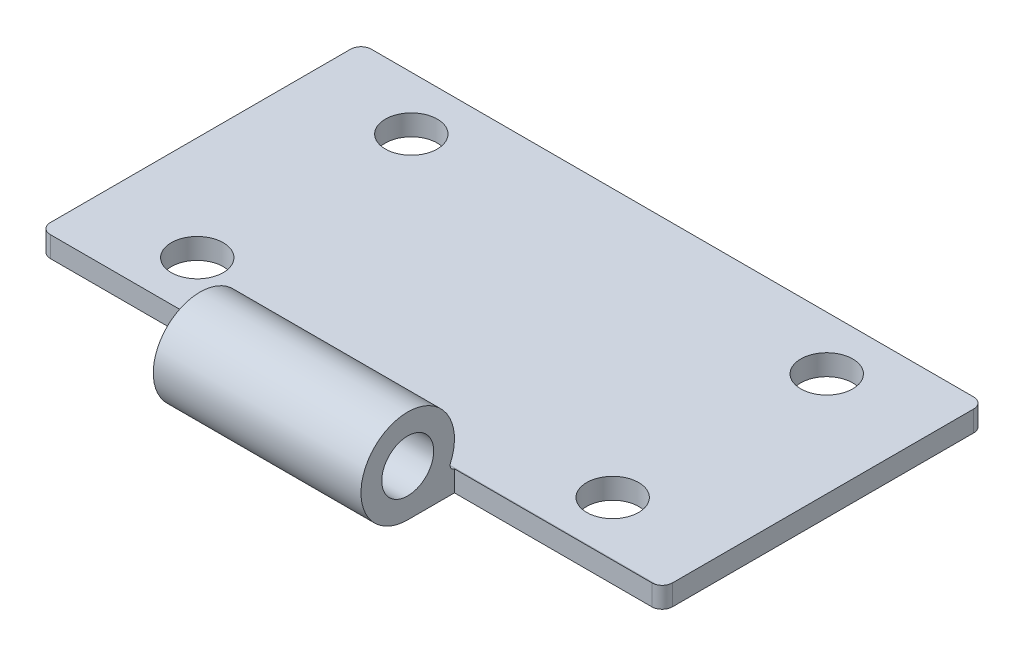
ISO-10303-21;
HEADER;
FILE_DESCRIPTION(('STEP AP214'),'2;1');
FILE_NAME('part.step','',(''),(''),'','','');
FILE_SCHEMA(('AUTOMOTIVE_DESIGN { 1 0 10303 214 1 1 1 1 }'));
ENDSEC;
DATA;
#1=APPLICATION_CONTEXT('core data for automotive mechanical design processes');
#2=APPLICATION_PROTOCOL_DEFINITION('international standard','automotive_design',2000,#1);
#3=PRODUCT_CONTEXT('',#1,'mechanical');
#4=PRODUCT('Part','Part','',(#3));
#5=PRODUCT_RELATED_PRODUCT_CATEGORY('part','',(#4));
#6=PRODUCT_DEFINITION_FORMATION('','',#4);
#7=PRODUCT_DEFINITION_CONTEXT('part definition',#1,'design');
#8=PRODUCT_DEFINITION('design','',#6,#7);
#9=PRODUCT_DEFINITION_SHAPE('','',#8);
#10=(LENGTH_UNIT() NAMED_UNIT(*) SI_UNIT(.MILLI.,.METRE.));
#11=(NAMED_UNIT(*) PLANE_ANGLE_UNIT() SI_UNIT($,.RADIAN.));
#12=(NAMED_UNIT(*) SI_UNIT($,.STERADIAN.) SOLID_ANGLE_UNIT());
#13=UNCERTAINTY_MEASURE_WITH_UNIT(LENGTH_MEASURE(1.E-05),#10,'distance_accuracy_value','');
#14=(GEOMETRIC_REPRESENTATION_CONTEXT(3) GLOBAL_UNCERTAINTY_ASSIGNED_CONTEXT((#13)) GLOBAL_UNIT_ASSIGNED_CONTEXT((#10,
#11,#12)) REPRESENTATION_CONTEXT('',''));
#15=CARTESIAN_POINT('',(0.,0.,0.));
#16=DIRECTION('',(0.,0.,1.));
#17=DIRECTION('',(1.,0.,0.));
#18=AXIS2_PLACEMENT_3D('',#15,#16,#17);
#19=CARTESIAN_POINT('',(60.,2.5,-217.887613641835));
#20=DIRECTION('',(1.,0.,0.));
#21=DIRECTION('',(0.,0.,-1.));
#22=AXIS2_PLACEMENT_3D('',#19,#20,#21);
#23=PLANE('',#22);
#24=DIRECTION('',(0.,0.,-1.));
#25=VECTOR('',#24,1.);
#26=CARTESIAN_POINT('',(60.,0.,-248.805037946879));
#27=LINE('',#26,#25);
#28=CARTESIAN_POINT('',(60.,0.,-218.805037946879));
#29=VERTEX_POINT('',#28);
#30=CARTESIAN_POINT('',(60.,0.,-247.805037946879));
#31=VERTEX_POINT('',#30);
#32=EDGE_CURVE('E185',#29,#31,#27,.T.);
#33=ORIENTED_EDGE('',*,*,#32,.T.);
#34=DIRECTION('',(0.,1.,0.));
#35=VECTOR('',#34,1.);
#36=CARTESIAN_POINT('',(60.,2.,-247.805037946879));
#37=LINE('',#36,#35);
#38=CARTESIAN_POINT('',(60.,2.,-247.805037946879));
#39=VERTEX_POINT('',#38);
#40=EDGE_CURVE('E235',#31,#39,#37,.T.);
#41=ORIENTED_EDGE('',*,*,#40,.T.);
#42=DIRECTION('',(0.,0.,1.));
#43=VECTOR('',#42,1.);
#44=CARTESIAN_POINT('',(60.,2.,-248.805037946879));
#45=LINE('',#44,#43);
#46=CARTESIAN_POINT('',(60.,2.,-218.805037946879));
#47=VERTEX_POINT('',#46);
#48=EDGE_CURVE('E182',#39,#47,#45,.T.);
#49=ORIENTED_EDGE('',*,*,#48,.T.);
#50=DIRECTION('',(0.,-1.,0.));
#51=VECTOR('',#50,1.);
#52=CARTESIAN_POINT('',(60.,2.5,-218.805037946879));
#53=LINE('',#52,#51);
#54=EDGE_CURVE('E232',#47,#29,#53,.T.);
#55=ORIENTED_EDGE('',*,*,#54,.T.);
#56=EDGE_LOOP('',(#33,#41,#49,#55));
#57=FACE_BOUND('',#56,.T.);
#58=ADVANCED_FACE('F40',(#57),#23,.T.);
#59=CARTESIAN_POINT('',(0.,2.5,-217.887613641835));
#60=DIRECTION('',(1.,0.,0.));
#61=DIRECTION('',(0.,0.,-1.));
#62=AXIS2_PLACEMENT_3D('',#59,#60,#61);
#63=PLANE('',#62);
#64=DIRECTION('',(0.,0.,1.));
#65=VECTOR('',#64,1.);
#66=CARTESIAN_POINT('',(0.,2.,-248.805037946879));
#67=LINE('',#66,#65);
#68=CARTESIAN_POINT('',(0.,2.,-247.805037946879));
#69=VERTEX_POINT('',#68);
#70=CARTESIAN_POINT('',(0.,2.,-218.887613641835));
#71=VERTEX_POINT('',#70);
#72=EDGE_CURVE('E181',#69,#71,#67,.T.);
#73=ORIENTED_EDGE('',*,*,#72,.F.);
#74=DIRECTION('',(0.,1.,0.));
#75=VECTOR('',#74,1.);
#76=CARTESIAN_POINT('',(0.,2.5,-247.805037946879));
#77=LINE('',#76,#75);
#78=CARTESIAN_POINT('',(0.,0.,-247.805037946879));
#79=VERTEX_POINT('',#78);
#80=EDGE_CURVE('E223',#69,#79,#77,.F.);
#81=ORIENTED_EDGE('',*,*,#80,.T.);
#82=DIRECTION('',(0.,0.,-1.));
#83=VECTOR('',#82,1.);
#84=CARTESIAN_POINT('',(0.,0.,-248.805037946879));
#85=LINE('',#84,#83);
#86=CARTESIAN_POINT('',(0.,0.,-218.887613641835));
#87=VERTEX_POINT('',#86);
#88=EDGE_CURVE('E186',#87,#79,#85,.T.);
#89=ORIENTED_EDGE('',*,*,#88,.F.);
#90=DIRECTION('',(0.,-1.,0.));
#91=VECTOR('',#90,1.);
#92=CARTESIAN_POINT('',(0.,2.,-218.887613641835));
#93=LINE('',#92,#91);
#94=EDGE_CURVE('E221',#87,#71,#93,.F.);
#95=ORIENTED_EDGE('',*,*,#94,.T.);
#96=EDGE_LOOP('',(#73,#81,#89,#95));
#97=FACE_BOUND('',#96,.T.);
#98=ADVANCED_FACE('F252',(#97),#63,.F.);
#99=CARTESIAN_POINT('',(60.,2.5,-217.887613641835));
#100=DIRECTION('',(-1.,0.,0.));
#101=DIRECTION('',(0.,0.,1.));
#102=AXIS2_PLACEMENT_3D('',#99,#100,#101);
#103=CYLINDRICAL_SURFACE('',#102,0.499999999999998);
#104=DIRECTION('',(-1.,0.,0.));
#105=VECTOR('',#104,1.);
#106=CARTESIAN_POINT('',(60.,2.00686588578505,-217.805037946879));
#107=LINE('',#106,#105);
#108=CARTESIAN_POINT('',(59.,2.00686588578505,-217.805037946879));
#109=VERTEX_POINT('',#108);
#110=CARTESIAN_POINT('',(40.,2.00686588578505,-217.805037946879));
#111=VERTEX_POINT('',#110);
#112=EDGE_CURVE('E177',#109,#111,#107,.T.);
#113=ORIENTED_EDGE('',*,*,#112,.F.);
#114=CARTESIAN_POINT('',(59.,2.00686588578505,-217.805037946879));
#115=CARTESIAN_POINT('',(59.0281968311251,2.00688494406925,-217.80503464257));
#116=CARTESIAN_POINT('',(59.056392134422,2.00666672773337,-217.806230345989));
#117=CARTESIAN_POINT('',(59.1125907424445,2.0058941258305,-217.810997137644));
#118=CARTESIAN_POINT('',(59.140593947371,2.00533957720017,-217.814569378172));
#119=CARTESIAN_POINT('',(59.1957223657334,2.00404397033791,-217.823986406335));
#120=CARTESIAN_POINT('',(59.2228544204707,2.00330621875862,-217.829791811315));
#121=CARTESIAN_POINT('',(59.2765295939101,2.00188910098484,-217.843633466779));
#122=CARTESIAN_POINT('',(59.3030731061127,2.00120969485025,-217.851668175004));
#123=CARTESIAN_POINT('',(59.3408174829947,2.00050324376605,-217.864828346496));
#124=CARTESIAN_POINT('',(59.3523260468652,2.0003236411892,-217.869080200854));
#125=CARTESIAN_POINT('',(59.3752232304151,2.00007195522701,-217.878021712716));
#126=CARTESIAN_POINT('',(59.3866112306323,2.00000028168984,-217.882712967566));
#127=CARTESIAN_POINT('',(59.3979103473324,2.,-217.887613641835));
#128=B_SPLINE_CURVE_WITH_KNOTS('',3,(#114,#115,#116,#117,#118,#119,#120,#121,#122,#123,#124,
#125,#126,#127),.UNSPECIFIED.,.F.,.F.,(4,2,2,2,2,2,4),(0.,0.0845622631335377,0.169165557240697,
0.252340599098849,0.33545824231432,0.372261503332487,0.40920417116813),.UNSPECIFIED.);
#129=CARTESIAN_POINT('',(59.3979103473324,2.,-217.887613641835));
#130=VERTEX_POINT('',#129);
#131=EDGE_CURVE('E48',#109,#130,#128,.T.);
#132=ORIENTED_EDGE('',*,*,#131,.T.);
#133=DIRECTION('',(-1.,0.,0.));
#134=VECTOR('',#133,1.);
#135=CARTESIAN_POINT('',(60.,2.,-217.887613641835));
#136=LINE('',#135,#134);
#137=CARTESIAN_POINT('',(20.,2.,-217.887613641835));
#138=VERTEX_POINT('',#137);
#139=EDGE_CURVE('E199',#130,#138,#136,.T.);
#140=ORIENTED_EDGE('',*,*,#139,.T.);
#141=CARTESIAN_POINT('',(20.,2.5,-217.887613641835));
#142=DIRECTION('',(-1.,0.,0.));
#143=DIRECTION('',(0.,0.,1.));
#144=AXIS2_PLACEMENT_3D('',#141,#142,#143);
#145=CIRCLE('',#144,0.499999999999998);
#146=CARTESIAN_POINT('',(20.,2.69999999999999,-217.429356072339));
#147=VERTEX_POINT('',#146);
#148=EDGE_CURVE('E140',#147,#138,#145,.F.);
#149=ORIENTED_EDGE('',*,*,#148,.F.);
#150=DIRECTION('',(-1.,0.,0.));
#151=VECTOR('',#150,1.);
#152=CARTESIAN_POINT('',(60.,2.69999999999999,-217.429356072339));
#153=LINE('',#152,#151);
#154=CARTESIAN_POINT('',(40.,2.69999999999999,-217.429356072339));
#155=VERTEX_POINT('',#154);
#156=EDGE_CURVE('E196',#155,#147,#153,.T.);
#157=ORIENTED_EDGE('',*,*,#156,.F.);
#158=CARTESIAN_POINT('',(40.,2.5,-217.887613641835));
#159=DIRECTION('',(1.,0.,0.));
#160=DIRECTION('',(0.,0.,-1.));
#161=AXIS2_PLACEMENT_3D('',#158,#159,#160);
#162=CIRCLE('',#161,0.499999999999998);
#163=EDGE_CURVE('E171',#111,#155,#162,.F.);
#164=ORIENTED_EDGE('',*,*,#163,.F.);
#165=EDGE_LOOP('',(#113,#132,#140,#149,#157,#164));
#166=FACE_BOUND('',#165,.T.);
#167=ADVANCED_FACE('F246',(#166),#103,.F.);
#168=CARTESIAN_POINT('',(60.,4.5,-213.305037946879));
#169=DIRECTION('',(-1.,0.,0.));
#170=DIRECTION('',(0.,0.,1.));
#171=AXIS2_PLACEMENT_3D('',#168,#169,#170);
#172=CYLINDRICAL_SURFACE('',#171,4.49999999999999);
#173=CARTESIAN_POINT('',(20.,4.5,-213.305037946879));
#174=DIRECTION('',(-1.,0.,0.));
#175=DIRECTION('',(0.,0.,1.));
#176=AXIS2_PLACEMENT_3D('',#173,#174,#175);
#177=CIRCLE('',#176,4.49999999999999);
#178=CARTESIAN_POINT('',(20.,0.,-213.305037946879));
#179=VERTEX_POINT('',#178);
#180=EDGE_CURVE('E174',#179,#147,#177,.T.);
#181=ORIENTED_EDGE('',*,*,#180,.F.);
#182=DIRECTION('',(-1.,0.,0.));
#183=VECTOR('',#182,1.);
#184=CARTESIAN_POINT('',(60.,0.,-213.305037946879));
#185=LINE('',#184,#183);
#186=CARTESIAN_POINT('',(40.,0.,-213.305037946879));
#187=VERTEX_POINT('',#186);
#188=EDGE_CURVE('E155',#187,#179,#185,.T.);
#189=ORIENTED_EDGE('',*,*,#188,.F.);
#190=CARTESIAN_POINT('',(40.,4.5,-213.305037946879));
#191=DIRECTION('',(1.,0.,0.));
#192=DIRECTION('',(0.,0.,-1.));
#193=AXIS2_PLACEMENT_3D('',#190,#191,#192);
#194=CIRCLE('',#193,4.49999999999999);
#195=EDGE_CURVE('E168',#155,#187,#194,.T.);
#196=ORIENTED_EDGE('',*,*,#195,.F.);
#197=ORIENTED_EDGE('',*,*,#156,.T.);
#198=EDGE_LOOP('',(#181,#189,#196,#197));
#199=FACE_BOUND('',#198,.T.);
#200=ADVANCED_FACE('F251',(#199),#172,.T.);
#201=CARTESIAN_POINT('',(60.,0.,-248.805037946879));
#202=DIRECTION('',(0.,1.,0.));
#203=DIRECTION('',(0.,0.,1.));
#204=AXIS2_PLACEMENT_3D('',#201,#202,#203);
#205=PLANE('',#204);
#206=CARTESIAN_POINT('',(50.,0.,-243.652133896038));
#207=DIRECTION('',(0.,1.,0.));
#208=DIRECTION('',(0.,0.,1.));
#209=AXIS2_PLACEMENT_3D('',#206,#207,#208);
#210=CIRCLE('',#209,2.5);
#211=CARTESIAN_POINT('',(50.,0.,-241.152133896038));
#212=VERTEX_POINT('',#211);
#213=EDGE_CURVE('E162',#212,#212,#210,.T.);
#214=ORIENTED_EDGE('',*,*,#213,.T.);
#215=EDGE_LOOP('',(#214));
#216=FACE_BOUND('',#215,.T.);
#217=CARTESIAN_POINT('',(50.,0.,-223.040517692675));
#218=DIRECTION('',(0.,1.,0.));
#219=DIRECTION('',(0.,0.,1.));
#220=AXIS2_PLACEMENT_3D('',#217,#218,#219);
#221=CIRCLE('',#220,2.5);
#222=CARTESIAN_POINT('',(50.,0.,-220.540517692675));
#223=VERTEX_POINT('',#222);
#224=EDGE_CURVE('E299',#223,#223,#221,.T.);
#225=ORIENTED_EDGE('',*,*,#224,.T.);
#226=EDGE_LOOP('',(#225));
#227=FACE_BOUND('',#226,.T.);
#228=CARTESIAN_POINT('',(10.,0.,-223.040517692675));
#229=DIRECTION('',(0.,1.,0.));
#230=DIRECTION('',(0.,0.,1.));
#231=AXIS2_PLACEMENT_3D('',#228,#229,#230);
#232=CIRCLE('',#231,2.5);
#233=CARTESIAN_POINT('',(10.,0.,-220.540517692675));
#234=VERTEX_POINT('',#233);
#235=EDGE_CURVE('E303',#234,#234,#232,.T.);
#236=ORIENTED_EDGE('',*,*,#235,.T.);
#237=EDGE_LOOP('',(#236));
#238=FACE_BOUND('',#237,.T.);
#239=CARTESIAN_POINT('',(10.,0.,-243.652133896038));
#240=DIRECTION('',(0.,1.,0.));
#241=DIRECTION('',(0.,0.,1.));
#242=AXIS2_PLACEMENT_3D('',#239,#240,#241);
#243=CIRCLE('',#242,2.5);
#244=CARTESIAN_POINT('',(10.,0.,-241.152133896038));
#245=VERTEX_POINT('',#244);
#246=EDGE_CURVE('E306',#245,#245,#243,.T.);
#247=ORIENTED_EDGE('',*,*,#246,.T.);
#248=EDGE_LOOP('',(#247));
#249=FACE_BOUND('',#248,.T.);
#250=ORIENTED_EDGE('',*,*,#88,.T.);
#251=CARTESIAN_POINT('',(1.,0.,-247.805037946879));
#252=DIRECTION('',(0.,1.,0.));
#253=DIRECTION('',(0.,0.,1.));
#254=AXIS2_PLACEMENT_3D('',#251,#252,#253);
#255=CIRCLE('',#254,1.);
#256=CARTESIAN_POINT('',(1.,0.,-248.805037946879));
#257=VERTEX_POINT('',#256);
#258=EDGE_CURVE('E230',#79,#257,#255,.F.);
#259=ORIENTED_EDGE('',*,*,#258,.T.);
#260=DIRECTION('',(-1.,0.,0.));
#261=VECTOR('',#260,1.);
#262=CARTESIAN_POINT('',(60.,0.,-248.805037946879));
#263=LINE('',#262,#261);
#264=CARTESIAN_POINT('',(59.,0.,-248.805037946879));
#265=VERTEX_POINT('',#264);
#266=EDGE_CURVE('E189',#265,#257,#263,.T.);
#267=ORIENTED_EDGE('',*,*,#266,.F.);
#268=CARTESIAN_POINT('',(59.,0.,-247.805037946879));
#269=DIRECTION('',(0.,1.,0.));
#270=DIRECTION('',(0.,0.,1.));
#271=AXIS2_PLACEMENT_3D('',#268,#269,#270);
#272=CIRCLE('',#271,1.);
#273=EDGE_CURVE('E228',#265,#31,#272,.F.);
#274=ORIENTED_EDGE('',*,*,#273,.T.);
#275=ORIENTED_EDGE('',*,*,#32,.F.);
#276=CARTESIAN_POINT('',(59.,0.,-218.805037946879));
#277=DIRECTION('',(0.,1.,0.));
#278=DIRECTION('',(0.,0.,1.));
#279=AXIS2_PLACEMENT_3D('',#276,#277,#278);
#280=CIRCLE('',#279,1.);
#281=CARTESIAN_POINT('',(59.,0.,-217.805037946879));
#282=VERTEX_POINT('',#281);
#283=EDGE_CURVE('E63',#29,#282,#280,.F.);
#284=ORIENTED_EDGE('',*,*,#283,.T.);
#285=DIRECTION('',(-1.,0.,0.));
#286=VECTOR('',#285,1.);
#287=CARTESIAN_POINT('',(60.,0.,-217.805037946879));
#288=LINE('',#287,#286);
#289=CARTESIAN_POINT('',(40.,0.,-217.805037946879));
#290=VERTEX_POINT('',#289);
#291=EDGE_CURVE('E165',#282,#290,#288,.T.);
#292=ORIENTED_EDGE('',*,*,#291,.T.);
#293=DIRECTION('',(0.,0.,1.));
#294=VECTOR('',#293,1.);
#295=CARTESIAN_POINT('',(40.,0.,-217.805037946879));
#296=LINE('',#295,#294);
#297=EDGE_CURVE('E159',#290,#187,#296,.T.);
#298=ORIENTED_EDGE('',*,*,#297,.T.);
#299=ORIENTED_EDGE('',*,*,#188,.T.);
#300=DIRECTION('',(0.,0.,-1.));
#301=VECTOR('',#300,1.);
#302=CARTESIAN_POINT('',(20.,0.,-208.805037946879));
#303=LINE('',#302,#301);
#304=CARTESIAN_POINT('',(20.,0.,-217.887613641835));
#305=VERTEX_POINT('',#304);
#306=EDGE_CURVE('E137',#179,#305,#303,.T.);
#307=ORIENTED_EDGE('',*,*,#306,.T.);
#308=DIRECTION('',(-1.,0.,0.));
#309=VECTOR('',#308,1.);
#310=CARTESIAN_POINT('',(0.,0.,-217.887613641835));
#311=LINE('',#310,#309);
#312=CARTESIAN_POINT('',(1.,0.,-217.887613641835));
#313=VERTEX_POINT('',#312);
#314=EDGE_CURVE('E145',#305,#313,#311,.T.);
#315=ORIENTED_EDGE('',*,*,#314,.T.);
#316=CARTESIAN_POINT('',(1.,0.,-218.887613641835));
#317=DIRECTION('',(0.,1.,0.));
#318=DIRECTION('',(0.,0.,1.));
#319=AXIS2_PLACEMENT_3D('',#316,#317,#318);
#320=CIRCLE('',#319,1.);
#321=EDGE_CURVE('E225',#313,#87,#320,.F.);
#322=ORIENTED_EDGE('',*,*,#321,.T.);
#323=EDGE_LOOP('',(#250,#259,#267,#274,#275,#284,#292,#298,#299,#307,#315,#322));
#324=FACE_BOUND('',#323,.T.);
#325=ADVANCED_FACE('F152',(#216,#227,#238,#249,#324),#205,.F.);
#326=CARTESIAN_POINT('',(60.,0.,-248.805037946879));
#327=DIRECTION('',(0.,0.,1.));
#328=DIRECTION('',(1.,0.,0.));
#329=AXIS2_PLACEMENT_3D('',#326,#327,#328);
#330=PLANE('',#329);
#331=ORIENTED_EDGE('',*,*,#266,.T.);
#332=DIRECTION('',(0.,1.,0.));
#333=VECTOR('',#332,1.);
#334=CARTESIAN_POINT('',(1.,0.,-248.805037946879));
#335=LINE('',#334,#333);
#336=CARTESIAN_POINT('',(1.,2.,-248.805037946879));
#337=VERTEX_POINT('',#336);
#338=EDGE_CURVE('E210',#257,#337,#335,.T.);
#339=ORIENTED_EDGE('',*,*,#338,.T.);
#340=DIRECTION('',(-1.,0.,0.));
#341=VECTOR('',#340,1.);
#342=CARTESIAN_POINT('',(60.,2.,-248.805037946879));
#343=LINE('',#342,#341);
#344=CARTESIAN_POINT('',(59.,2.,-248.805037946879));
#345=VERTEX_POINT('',#344);
#346=EDGE_CURVE('E201',#345,#337,#343,.T.);
#347=ORIENTED_EDGE('',*,*,#346,.F.);
#348=DIRECTION('',(0.,1.,0.));
#349=VECTOR('',#348,1.);
#350=CARTESIAN_POINT('',(59.,0.,-248.805037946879));
#351=LINE('',#350,#349);
#352=EDGE_CURVE('E204',#345,#265,#351,.F.);
#353=ORIENTED_EDGE('',*,*,#352,.T.);
#354=EDGE_LOOP('',(#331,#339,#347,#353));
#355=FACE_BOUND('',#354,.T.);
#356=ADVANCED_FACE('F259',(#355),#330,.F.);
#357=CARTESIAN_POINT('',(60.,2.,-248.805037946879));
#358=DIRECTION('',(0.,-1.,0.));
#359=DIRECTION('',(0.,0.,-1.));
#360=AXIS2_PLACEMENT_3D('',#357,#358,#359);
#361=PLANE('',#360);
#362=CARTESIAN_POINT('',(50.,2.,-243.652133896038));
#363=DIRECTION('',(0.,1.,0.));
#364=DIRECTION('',(0.,0.,1.));
#365=AXIS2_PLACEMENT_3D('',#362,#363,#364);
#366=CIRCLE('',#365,2.5);
#367=CARTESIAN_POINT('',(50.,2.,-241.152133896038));
#368=VERTEX_POINT('',#367);
#369=EDGE_CURVE('E315',#368,#368,#366,.T.);
#370=ORIENTED_EDGE('',*,*,#369,.F.);
#371=EDGE_LOOP('',(#370));
#372=FACE_BOUND('',#371,.T.);
#373=CARTESIAN_POINT('',(50.,2.,-223.040517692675));
#374=DIRECTION('',(0.,1.,0.));
#375=DIRECTION('',(0.,0.,1.));
#376=AXIS2_PLACEMENT_3D('',#373,#374,#375);
#377=CIRCLE('',#376,2.5);
#378=CARTESIAN_POINT('',(50.,2.,-220.540517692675));
#379=VERTEX_POINT('',#378);
#380=EDGE_CURVE('E318',#379,#379,#377,.T.);
#381=ORIENTED_EDGE('',*,*,#380,.F.);
#382=EDGE_LOOP('',(#381));
#383=FACE_BOUND('',#382,.T.);
#384=CARTESIAN_POINT('',(10.,2.,-223.040517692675));
#385=DIRECTION('',(0.,1.,0.));
#386=DIRECTION('',(0.,0.,1.));
#387=AXIS2_PLACEMENT_3D('',#384,#385,#386);
#388=CIRCLE('',#387,2.5);
#389=CARTESIAN_POINT('',(10.,2.,-220.540517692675));
#390=VERTEX_POINT('',#389);
#391=EDGE_CURVE('E312',#390,#390,#388,.T.);
#392=ORIENTED_EDGE('',*,*,#391,.F.);
#393=EDGE_LOOP('',(#392));
#394=FACE_BOUND('',#393,.T.);
#395=CARTESIAN_POINT('',(10.,2.,-243.652133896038));
#396=DIRECTION('',(0.,1.,0.));
#397=DIRECTION('',(0.,0.,1.));
#398=AXIS2_PLACEMENT_3D('',#395,#396,#397);
#399=CIRCLE('',#398,2.5);
#400=CARTESIAN_POINT('',(10.,2.,-241.152133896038));
#401=VERTEX_POINT('',#400);
#402=EDGE_CURVE('E308',#401,#401,#399,.T.);
#403=ORIENTED_EDGE('',*,*,#402,.F.);
#404=EDGE_LOOP('',(#403));
#405=FACE_BOUND('',#404,.T.);
#406=ORIENTED_EDGE('',*,*,#346,.T.);
#407=CARTESIAN_POINT('',(1.,2.,-247.805037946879));
#408=DIRECTION('',(0.,-1.,0.));
#409=DIRECTION('',(0.,0.,-1.));
#410=AXIS2_PLACEMENT_3D('',#407,#408,#409);
#411=CIRCLE('',#410,1.);
#412=EDGE_CURVE('E219',#337,#69,#411,.F.);
#413=ORIENTED_EDGE('',*,*,#412,.T.);
#414=ORIENTED_EDGE('',*,*,#72,.T.);
#415=CARTESIAN_POINT('',(1.,1.99999999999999,-218.887613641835));
#416=DIRECTION('',(0.,-1.,0.));
#417=DIRECTION('',(0.,0.,-1.));
#418=AXIS2_PLACEMENT_3D('',#415,#416,#417);
#419=CIRCLE('',#418,1.);
#420=CARTESIAN_POINT('',(1.,2.,-217.887613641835));
#421=VERTEX_POINT('',#420);
#422=EDGE_CURVE('E213',#71,#421,#419,.F.);
#423=ORIENTED_EDGE('',*,*,#422,.T.);
#424=DIRECTION('',(-1.,0.,0.));
#425=VECTOR('',#424,1.);
#426=CARTESIAN_POINT('',(60.,2.,-217.887613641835));
#427=LINE('',#426,#425);
#428=EDGE_CURVE('E179',#138,#421,#427,.T.);
#429=ORIENTED_EDGE('',*,*,#428,.F.);
#430=ORIENTED_EDGE('',*,*,#139,.F.);
#431=CARTESIAN_POINT('',(59.,2.,-218.805037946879));
#432=DIRECTION('',(0.,-1.,0.));
#433=DIRECTION('',(0.,0.,-1.));
#434=AXIS2_PLACEMENT_3D('',#431,#432,#433);
#435=CIRCLE('',#434,1.);
#436=EDGE_CURVE('E215',#130,#47,#435,.F.);
#437=ORIENTED_EDGE('',*,*,#436,.T.);
#438=ORIENTED_EDGE('',*,*,#48,.F.);
#439=CARTESIAN_POINT('',(59.,2.,-247.805037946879));
#440=DIRECTION('',(0.,-1.,0.));
#441=DIRECTION('',(0.,0.,-1.));
#442=AXIS2_PLACEMENT_3D('',#439,#440,#441);
#443=CIRCLE('',#442,1.);
#444=EDGE_CURVE('E217',#39,#345,#443,.F.);
#445=ORIENTED_EDGE('',*,*,#444,.T.);
#446=EDGE_LOOP('',(#406,#413,#414,#423,#429,#430,#437,#438,#445));
#447=FACE_BOUND('',#446,.T.);
#448=ADVANCED_FACE('F255',(#372,#383,#394,#405,#447),#361,.F.);
#449=CARTESIAN_POINT('',(60.,60.,-217.805037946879));
#450=DIRECTION('',(0.,0.,1.));
#451=DIRECTION('',(1.,0.,0.));
#452=AXIS2_PLACEMENT_3D('',#449,#450,#451);
#453=PLANE('',#452);
#454=ORIENTED_EDGE('',*,*,#291,.F.);
#455=DIRECTION('',(0.,-1.,0.));
#456=VECTOR('',#455,1.);
#457=CARTESIAN_POINT('',(59.,60.,-217.805037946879));
#458=LINE('',#457,#456);
#459=EDGE_CURVE('E55',#282,#109,#458,.F.);
#460=ORIENTED_EDGE('',*,*,#459,.T.);
#461=ORIENTED_EDGE('',*,*,#112,.T.);
#462=DIRECTION('',(0.,-1.,0.));
#463=VECTOR('',#462,1.);
#464=CARTESIAN_POINT('',(40.,60.,-217.805037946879));
#465=LINE('',#464,#463);
#466=EDGE_CURVE('E156',#111,#290,#465,.T.);
#467=ORIENTED_EDGE('',*,*,#466,.T.);
#468=EDGE_LOOP('',(#454,#460,#461,#467));
#469=FACE_BOUND('',#468,.T.);
#470=ADVANCED_FACE('F258',(#469),#453,.T.);
#471=CARTESIAN_POINT('',(40.,60.,-217.805037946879));
#472=DIRECTION('',(1.,0.,0.));
#473=DIRECTION('',(0.,0.,-1.));
#474=AXIS2_PLACEMENT_3D('',#471,#472,#473);
#475=PLANE('',#474);
#476=CARTESIAN_POINT('',(40.,4.5,-213.305037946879));
#477=DIRECTION('',(1.,0.,0.));
#478=DIRECTION('',(0.,0.,-1.));
#479=AXIS2_PLACEMENT_3D('',#476,#477,#478);
#480=CIRCLE('',#479,2.5);
#481=CARTESIAN_POINT('',(40.,4.5,-215.805037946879));
#482=VERTEX_POINT('',#481);
#483=EDGE_CURVE('E144',#482,#482,#480,.T.);
#484=ORIENTED_EDGE('',*,*,#483,.F.);
#485=EDGE_LOOP('',(#484));
#486=FACE_BOUND('',#485,.T.);
#487=ORIENTED_EDGE('',*,*,#195,.T.);
#488=ORIENTED_EDGE('',*,*,#297,.F.);
#489=ORIENTED_EDGE('',*,*,#466,.F.);
#490=ORIENTED_EDGE('',*,*,#163,.T.);
#491=EDGE_LOOP('',(#487,#488,#489,#490));
#492=FACE_BOUND('',#491,.T.);
#493=ADVANCED_FACE('F376',(#486,#492),#475,.T.);
#494=CARTESIAN_POINT('',(0.,60.,-217.887613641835));
#495=DIRECTION('',(0.,0.,1.));
#496=DIRECTION('',(1.,0.,0.));
#497=AXIS2_PLACEMENT_3D('',#494,#495,#496);
#498=PLANE('',#497);
#499=ORIENTED_EDGE('',*,*,#428,.T.);
#500=DIRECTION('',(0.,-1.,0.));
#501=VECTOR('',#500,1.);
#502=CARTESIAN_POINT('',(1.,0.,-217.887613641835));
#503=LINE('',#502,#501);
#504=EDGE_CURVE('E11',#421,#313,#503,.T.);
#505=ORIENTED_EDGE('',*,*,#504,.T.);
#506=ORIENTED_EDGE('',*,*,#314,.F.);
#507=DIRECTION('',(0.,-1.,0.));
#508=VECTOR('',#507,1.);
#509=CARTESIAN_POINT('',(20.,60.,-217.887613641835));
#510=LINE('',#509,#508);
#511=EDGE_CURVE('E133',#138,#305,#510,.T.);
#512=ORIENTED_EDGE('',*,*,#511,.F.);
#513=EDGE_LOOP('',(#499,#505,#506,#512));
#514=FACE_BOUND('',#513,.T.);
#515=ADVANCED_FACE('F148',(#514),#498,.T.);
#516=CARTESIAN_POINT('',(20.,60.,-208.805037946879));
#517=DIRECTION('',(-1.,0.,0.));
#518=DIRECTION('',(0.,0.,1.));
#519=AXIS2_PLACEMENT_3D('',#516,#517,#518);
#520=PLANE('',#519);
#521=CARTESIAN_POINT('',(20.,4.5,-213.305037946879));
#522=DIRECTION('',(-1.,0.,0.));
#523=DIRECTION('',(0.,0.,1.));
#524=AXIS2_PLACEMENT_3D('',#521,#522,#523);
#525=CIRCLE('',#524,2.5);
#526=CARTESIAN_POINT('',(20.,4.5,-210.805037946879));
#527=VERTEX_POINT('',#526);
#528=EDGE_CURVE('E170',#527,#527,#525,.T.);
#529=ORIENTED_EDGE('',*,*,#528,.F.);
#530=EDGE_LOOP('',(#529));
#531=FACE_BOUND('',#530,.T.);
#532=ORIENTED_EDGE('',*,*,#148,.T.);
#533=ORIENTED_EDGE('',*,*,#511,.T.);
#534=ORIENTED_EDGE('',*,*,#306,.F.);
#535=ORIENTED_EDGE('',*,*,#180,.T.);
#536=EDGE_LOOP('',(#532,#533,#534,#535));
#537=FACE_BOUND('',#536,.T.);
#538=ADVANCED_FACE('F135',(#531,#537),#520,.T.);
#539=CARTESIAN_POINT('',(60.,4.5,-213.305037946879));
#540=DIRECTION('',(-1.,0.,0.));
#541=DIRECTION('',(0.,0.,1.));
#542=AXIS2_PLACEMENT_3D('',#539,#540,#541);
#543=CYLINDRICAL_SURFACE('',#542,2.5);
#544=ORIENTED_EDGE('',*,*,#483,.T.);
#545=EDGE_LOOP('',(#544));
#546=FACE_BOUND('',#545,.T.);
#547=ORIENTED_EDGE('',*,*,#528,.T.);
#548=EDGE_LOOP('',(#547));
#549=FACE_BOUND('',#548,.T.);
#550=ADVANCED_FACE('F285',(#546,#549),#543,.F.);
#551=CARTESIAN_POINT('',(10.,-58.,-243.652133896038));
#552=DIRECTION('',(0.,1.,0.));
#553=DIRECTION('',(0.,0.,1.));
#554=AXIS2_PLACEMENT_3D('',#551,#552,#553);
#555=CYLINDRICAL_SURFACE('',#554,2.5);
#556=ORIENTED_EDGE('',*,*,#402,.T.);
#557=EDGE_LOOP('',(#556));
#558=FACE_BOUND('',#557,.T.);
#559=ORIENTED_EDGE('',*,*,#246,.F.);
#560=EDGE_LOOP('',(#559));
#561=FACE_BOUND('',#560,.T.);
#562=ADVANCED_FACE('F447',(#558,#561),#555,.F.);
#563=CARTESIAN_POINT('',(10.,-58.,-223.040517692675));
#564=DIRECTION('',(0.,1.,0.));
#565=DIRECTION('',(0.,0.,1.));
#566=AXIS2_PLACEMENT_3D('',#563,#564,#565);
#567=CYLINDRICAL_SURFACE('',#566,2.5);
#568=ORIENTED_EDGE('',*,*,#391,.T.);
#569=EDGE_LOOP('',(#568));
#570=FACE_BOUND('',#569,.T.);
#571=ORIENTED_EDGE('',*,*,#235,.F.);
#572=EDGE_LOOP('',(#571));
#573=FACE_BOUND('',#572,.T.);
#574=ADVANCED_FACE('F324',(#570,#573),#567,.F.);
#575=CARTESIAN_POINT('',(50.,-58.,-223.040517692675));
#576=DIRECTION('',(0.,1.,0.));
#577=DIRECTION('',(0.,0.,1.));
#578=AXIS2_PLACEMENT_3D('',#575,#576,#577);
#579=CYLINDRICAL_SURFACE('',#578,2.5);
#580=ORIENTED_EDGE('',*,*,#380,.T.);
#581=EDGE_LOOP('',(#580));
#582=FACE_BOUND('',#581,.T.);
#583=ORIENTED_EDGE('',*,*,#224,.F.);
#584=EDGE_LOOP('',(#583));
#585=FACE_BOUND('',#584,.T.);
#586=ADVANCED_FACE('F428',(#582,#585),#579,.F.);
#587=CARTESIAN_POINT('',(50.,-58.,-243.652133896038));
#588=DIRECTION('',(0.,1.,0.));
#589=DIRECTION('',(0.,0.,1.));
#590=AXIS2_PLACEMENT_3D('',#587,#588,#589);
#591=CYLINDRICAL_SURFACE('',#590,2.5);
#592=ORIENTED_EDGE('',*,*,#369,.T.);
#593=EDGE_LOOP('',(#592));
#594=FACE_BOUND('',#593,.T.);
#595=ORIENTED_EDGE('',*,*,#213,.F.);
#596=EDGE_LOOP('',(#595));
#597=FACE_BOUND('',#596,.T.);
#598=ADVANCED_FACE('F267',(#594,#597),#591,.F.);
#599=CARTESIAN_POINT('',(1.,0.,-247.805037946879));
#600=DIRECTION('',(0.,1.,0.));
#601=DIRECTION('',(0.,0.,1.));
#602=AXIS2_PLACEMENT_3D('',#599,#600,#601);
#603=CYLINDRICAL_SURFACE('',#602,1.);
#604=ORIENTED_EDGE('',*,*,#258,.F.);
#605=ORIENTED_EDGE('',*,*,#80,.F.);
#606=ORIENTED_EDGE('',*,*,#412,.F.);
#607=ORIENTED_EDGE('',*,*,#338,.F.);
#608=EDGE_LOOP('',(#604,#605,#606,#607));
#609=FACE_BOUND('',#608,.T.);
#610=ADVANCED_FACE('F264',(#609),#603,.T.);
#611=CARTESIAN_POINT('',(59.,2.5,-247.805037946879));
#612=DIRECTION('',(0.,-1.,0.));
#613=DIRECTION('',(0.,0.,-1.));
#614=AXIS2_PLACEMENT_3D('',#611,#612,#613);
#615=CYLINDRICAL_SURFACE('',#614,1.);
#616=ORIENTED_EDGE('',*,*,#273,.F.);
#617=ORIENTED_EDGE('',*,*,#352,.F.);
#618=ORIENTED_EDGE('',*,*,#444,.F.);
#619=ORIENTED_EDGE('',*,*,#40,.F.);
#620=EDGE_LOOP('',(#616,#617,#618,#619));
#621=FACE_BOUND('',#620,.T.);
#622=ADVANCED_FACE('F266',(#621),#615,.T.);
#623=CARTESIAN_POINT('',(59.,2.5,-218.805037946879));
#624=DIRECTION('',(0.,-1.,0.));
#625=DIRECTION('',(0.,0.,-1.));
#626=AXIS2_PLACEMENT_3D('',#623,#624,#625);
#627=CYLINDRICAL_SURFACE('',#626,1.);
#628=ORIENTED_EDGE('',*,*,#131,.F.);
#629=ORIENTED_EDGE('',*,*,#459,.F.);
#630=ORIENTED_EDGE('',*,*,#283,.F.);
#631=ORIENTED_EDGE('',*,*,#54,.F.);
#632=ORIENTED_EDGE('',*,*,#436,.F.);
#633=EDGE_LOOP('',(#628,#629,#630,#631,#632));
#634=FACE_BOUND('',#633,.T.);
#635=ADVANCED_FACE('F243',(#634),#627,.T.);
#636=CARTESIAN_POINT('',(1.,60.,-218.887613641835));
#637=DIRECTION('',(0.,1.,0.));
#638=DIRECTION('',(0.,0.,1.));
#639=AXIS2_PLACEMENT_3D('',#636,#637,#638);
#640=CYLINDRICAL_SURFACE('',#639,1.);
#641=ORIENTED_EDGE('',*,*,#422,.F.);
#642=ORIENTED_EDGE('',*,*,#94,.F.);
#643=ORIENTED_EDGE('',*,*,#321,.F.);
#644=ORIENTED_EDGE('',*,*,#504,.F.);
#645=EDGE_LOOP('',(#641,#642,#643,#644));
#646=FACE_BOUND('',#645,.T.);
#647=ADVANCED_FACE('F42',(#646),#640,.T.);
#648=CLOSED_SHELL('',(#58,#98,#167,#200,#325,#356,#448,#470,#493,#515,#538,#550,#562,#574,#586,
#598,#610,#622,#635,#647));
#649=MANIFOLD_SOLID_BREP('B2',#648);
#650=ADVANCED_BREP_SHAPE_REPRESENTATION('',(#18,#649),#14);
#651=SHAPE_DEFINITION_REPRESENTATION(#9,#650);
ENDSEC;
END-ISO-10303-21;
